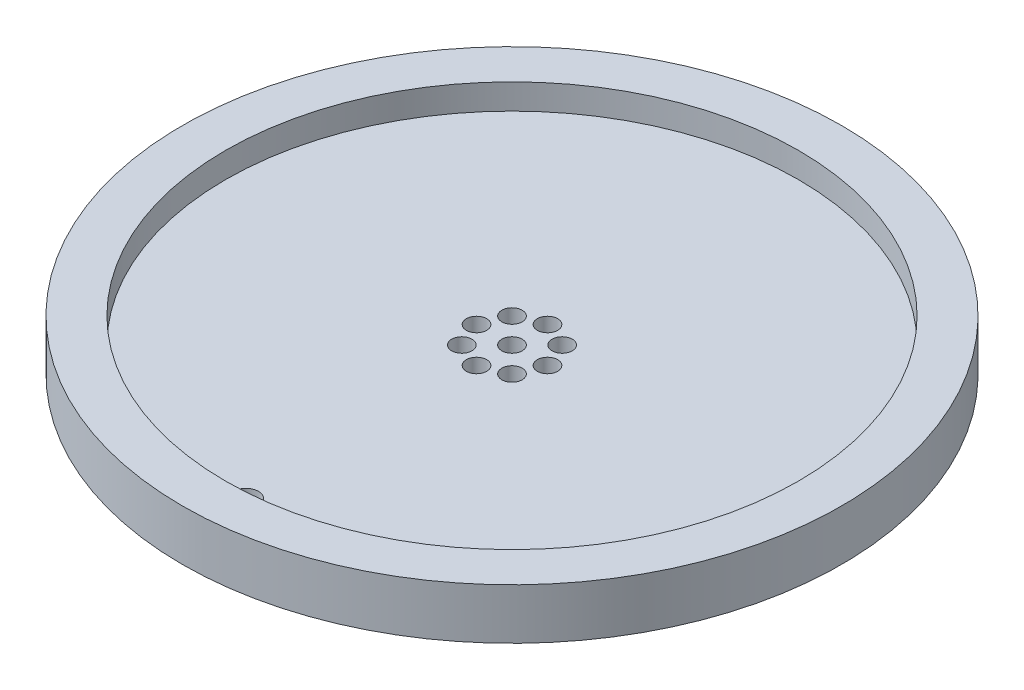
from build123d import *

# Parameters (mm, degrees)
SKETCH2_R           = 65
SKETCH2_R_2         = 2
BOSS_EXTRUDE1_DEPTH = 5
SKETCH3_R           = 2.5
CUT_EXTRUDE1_DEPTH  = 5
SKETCH6_R           = 65
SKETCH6_R_2         = 59
BOSS_EXTRUDE2_DEPTH = 5
SKETCH7_R           = 59
SKETCH7_R_2         = 56.5
BOSS_EXTRUDE3_DEPTH = 5


with BuildPart() as part:
    # Sketch2 → Boss-Extrude1 (new body)
    with BuildSketch(Plane(origin=(0, 0, 0), x_dir=(1, 0, 0), z_dir=(0, 1, 0))):
        with Locations(Location((0, 0, 0), (0, 0, 270))):
            Circle(SKETCH2_R)
        with Locations(Location((0, 0, 0), (0, 0, 270))):
            Circle(SKETCH2_R_2, mode=Mode.SUBTRACT)
        with Locations(Location((0, 7, 0), (0, 0, 270))):
            Circle(SKETCH2_R_2, mode=Mode.SUBTRACT)
        with Locations(Location((4.949747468, 4.949747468, 0), (0, 0, 270))):
            Circle(SKETCH2_R_2, mode=Mode.SUBTRACT)
        with Locations(Location((7, 0, 0), (0, 0, 270))):
            Circle(SKETCH2_R_2, mode=Mode.SUBTRACT)
        with Locations(Location((4.949747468, -4.949747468, 0), (0, 0, 270))):
            Circle(SKETCH2_R_2, mode=Mode.SUBTRACT)
        with Locations(Location((0, -7, 0), (0, 0, 270))):
            Circle(SKETCH2_R_2, mode=Mode.SUBTRACT)
        with Locations(Location((-4.949747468, -4.949747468, 0), (0, 0, 270))):
            Circle(SKETCH2_R_2, mode=Mode.SUBTRACT)
        with Locations(Location((-7, 0, 0), (0, 0, 270))):
            Circle(SKETCH2_R_2, mode=Mode.SUBTRACT)
        with Locations(Location((-4.949747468, 4.949747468, 0), (0, 0, 270))):
            Circle(SKETCH2_R_2, mode=Mode.SUBTRACT)
    extrude(amount=BOSS_EXTRUDE1_DEPTH)

    # Sketch3 → Cut-Extrude1 (cut)
    with BuildSketch(Plane.XZ):
        with Locations(Location((0, 52.5, 0), (0, 0, 270))):
            Circle(SKETCH3_R)
    extrude(amount=-CUT_EXTRUDE1_DEPTH, mode=Mode.SUBTRACT)

    # Sketch6 → Boss-Extrude2 (add)
    with BuildSketch(Plane(origin=(0, 5, 0), x_dir=(1, 0, 0), z_dir=(0, 1, 0))):
        with Locations(Location((0, 0, 0), (0, 0, 270))):
            Circle(SKETCH6_R)
        with Locations(Location((0, 0, 0), (0, 0, 270))):
            Circle(SKETCH6_R_2, mode=Mode.SUBTRACT)
    extrude(amount=BOSS_EXTRUDE2_DEPTH)

    # Sketch7 → Boss-Extrude3 (add)
    with BuildSketch(Plane(origin=(0, 5, 0), x_dir=(1, 0, 0), z_dir=(0, 1, 0))):
        Circle(SKETCH7_R)
        with Locations(Location((0, 0, 0), (0, 0, 270))):
            Circle(SKETCH7_R_2, mode=Mode.SUBTRACT)
    extrude(amount=BOSS_EXTRUDE3_DEPTH)


solid = part.part
